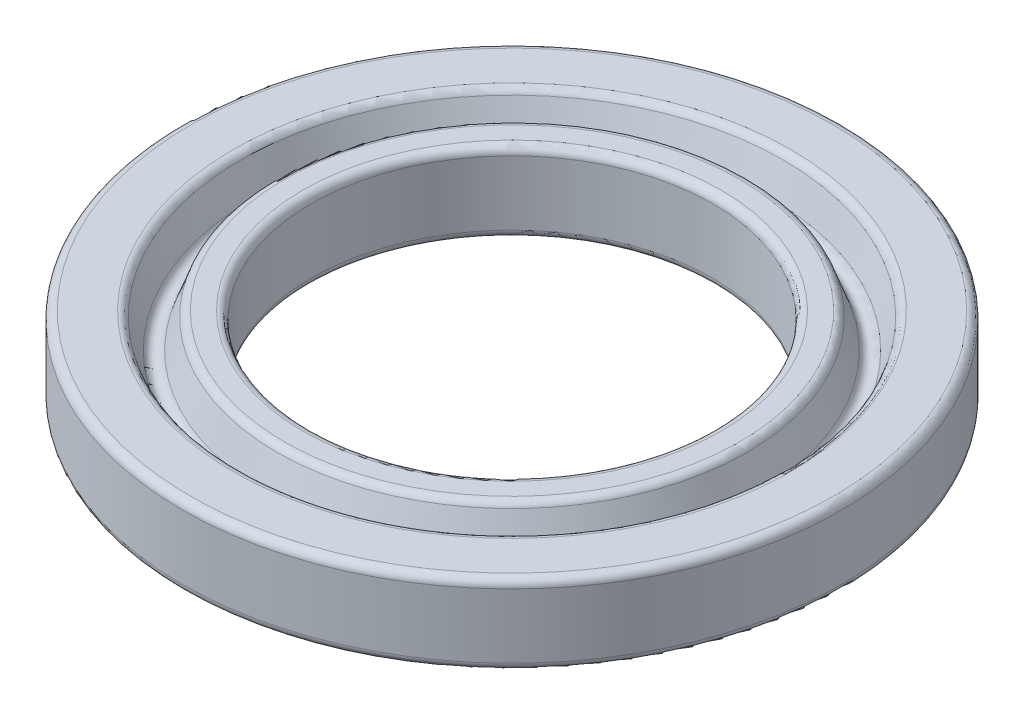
ISO-10303-21;
HEADER;
FILE_DESCRIPTION(('STEP AP214'),'2;1');
FILE_NAME('part.step','',(''),(''),'','','');
FILE_SCHEMA(('AUTOMOTIVE_DESIGN { 1 0 10303 214 1 1 1 1 }'));
ENDSEC;
DATA;
#1=APPLICATION_CONTEXT('core data for automotive mechanical design processes');
#2=APPLICATION_PROTOCOL_DEFINITION('international standard','automotive_design',2000,#1);
#3=PRODUCT_CONTEXT('',#1,'mechanical');
#4=PRODUCT('Part','Part','',(#3));
#5=PRODUCT_RELATED_PRODUCT_CATEGORY('part','',(#4));
#6=PRODUCT_DEFINITION_FORMATION('','',#4);
#7=PRODUCT_DEFINITION_CONTEXT('part definition',#1,'design');
#8=PRODUCT_DEFINITION('design','',#6,#7);
#9=PRODUCT_DEFINITION_SHAPE('','',#8);
#10=(LENGTH_UNIT() NAMED_UNIT(*) SI_UNIT(.MILLI.,.METRE.));
#11=(NAMED_UNIT(*) PLANE_ANGLE_UNIT() SI_UNIT($,.RADIAN.));
#12=(NAMED_UNIT(*) SI_UNIT($,.STERADIAN.) SOLID_ANGLE_UNIT());
#13=UNCERTAINTY_MEASURE_WITH_UNIT(LENGTH_MEASURE(1.E-05),#10,'distance_accuracy_value','');
#14=(GEOMETRIC_REPRESENTATION_CONTEXT(3) GLOBAL_UNCERTAINTY_ASSIGNED_CONTEXT((#13)) GLOBAL_UNIT_ASSIGNED_CONTEXT((#10,
#11,#12)) REPRESENTATION_CONTEXT('',''));
#15=CARTESIAN_POINT('',(0.,0.,0.));
#16=DIRECTION('',(0.,0.,1.));
#17=DIRECTION('',(1.,0.,0.));
#18=AXIS2_PLACEMENT_3D('',#15,#16,#17);
#19=CARTESIAN_POINT('',(0.,40.,0.));
#20=DIRECTION('',(0.,1.,0.));
#21=DIRECTION('',(0.,0.,1.));
#22=AXIS2_PLACEMENT_3D('',#19,#20,#21);
#23=CYLINDRICAL_SURFACE('',#22,6.25000000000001);
#24=CARTESIAN_POINT('',(0.,0.25,0.));
#25=DIRECTION('',(0.,1.,0.));
#26=DIRECTION('',(0.,0.,1.));
#27=AXIS2_PLACEMENT_3D('',#24,#25,#26);
#28=CIRCLE('',#27,6.25000000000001);
#29=CARTESIAN_POINT('',(0.,0.249999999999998,6.25000000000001));
#30=VERTEX_POINT('',#29);
#31=EDGE_CURVE('E62',#30,#30,#28,.F.);
#32=ORIENTED_EDGE('',*,*,#31,.T.);
#33=EDGE_LOOP('',(#32));
#34=FACE_BOUND('',#33,.T.);
#35=CARTESIAN_POINT('',(0.,2.25,0.));
#36=DIRECTION('',(0.,-1.,0.));
#37=DIRECTION('',(0.,0.,-1.));
#38=AXIS2_PLACEMENT_3D('',#35,#36,#37);
#39=CIRCLE('',#38,6.25000000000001);
#40=CARTESIAN_POINT('',(0.,2.25,-6.25000000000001));
#41=VERTEX_POINT('',#40);
#42=EDGE_CURVE('E65',#41,#41,#39,.F.);
#43=ORIENTED_EDGE('',*,*,#42,.T.);
#44=EDGE_LOOP('',(#43));
#45=FACE_BOUND('',#44,.T.);
#46=ADVANCED_FACE('F31',(#34,#45),#23,.F.);
#47=CARTESIAN_POINT('',(6.24999999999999,2.5,0.));
#48=DIRECTION('',(0.,-1.,0.));
#49=DIRECTION('',(0.,0.,-1.));
#50=AXIS2_PLACEMENT_3D('',#47,#48,#49);
#51=PLANE('',#50);
#52=CARTESIAN_POINT('',(0.,2.5,0.));
#53=DIRECTION('',(0.,-1.,0.));
#54=DIRECTION('',(0.,0.,-1.));
#55=AXIS2_PLACEMENT_3D('',#52,#53,#54);
#56=CIRCLE('',#55,7.07494811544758);
#57=CARTESIAN_POINT('',(0.,2.5,-7.07494811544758));
#58=VERTEX_POINT('',#57);
#59=EDGE_CURVE('E41',#58,#58,#56,.F.);
#60=ORIENTED_EDGE('',*,*,#59,.T.);
#61=EDGE_LOOP('',(#60));
#62=FACE_BOUND('',#61,.T.);
#63=CARTESIAN_POINT('',(0.,2.5,0.));
#64=DIRECTION('',(0.,-1.,0.));
#65=DIRECTION('',(0.,0.,-1.));
#66=AXIS2_PLACEMENT_3D('',#63,#64,#65);
#67=CIRCLE('',#66,6.50000000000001);
#68=CARTESIAN_POINT('',(0.,2.5,-6.50000000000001));
#69=VERTEX_POINT('',#68);
#70=EDGE_CURVE('E45',#69,#69,#67,.T.);
#71=ORIENTED_EDGE('',*,*,#70,.T.);
#72=EDGE_LOOP('',(#71));
#73=FACE_BOUND('',#72,.T.);
#74=ADVANCED_FACE('F113',(#62,#73),#51,.F.);
#75=CARTESIAN_POINT('',(0.,0.782826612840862,0.));
#76=DIRECTION('',(0.,-1.,0.));
#77=DIRECTION('',(0.,0.,-1.));
#78=AXIS2_PLACEMENT_3D('',#75,#76,#77);
#79=CONICAL_SURFACE('',#78,7.875,0.349065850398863);
#80=CARTESIAN_POINT('',(0.,1.42827267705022,0.));
#81=DIRECTION('',(0.,-1.,0.));
#82=DIRECTION('',(0.,0.,-1.));
#83=AXIS2_PLACEMENT_3D('',#80,#81,#82);
#84=CIRCLE('',#83,7.64007684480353);
#85=CARTESIAN_POINT('',(0.,1.42827267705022,-7.64007684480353));
#86=VERTEX_POINT('',#85);
#87=EDGE_CURVE('E80',#86,#86,#84,.F.);
#88=ORIENTED_EDGE('',*,*,#87,.T.);
#89=EDGE_LOOP('',(#88));
#90=FACE_BOUND('',#89,.T.);
#91=CARTESIAN_POINT('',(0.,2.33550503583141,0.));
#92=DIRECTION('',(0.,1.,0.));
#93=DIRECTION('',(0.,0.,1.));
#94=AXIS2_PLACEMENT_3D('',#91,#92,#93);
#95=CIRCLE('',#94,7.30987127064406);
#96=CARTESIAN_POINT('',(0.,2.33550503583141,7.30987127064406));
#97=VERTEX_POINT('',#96);
#98=EDGE_CURVE('E83',#97,#97,#95,.F.);
#99=ORIENTED_EDGE('',*,*,#98,.T.);
#100=EDGE_LOOP('',(#99));
#101=FACE_BOUND('',#100,.T.);
#102=ADVANCED_FACE('F118',(#90,#101),#79,.T.);
#103=CARTESIAN_POINT('',(0.,2.5,0.));
#104=DIRECTION('',(0.,1.,0.));
#105=DIRECTION('',(0.,0.,1.));
#106=AXIS2_PLACEMENT_3D('',#103,#104,#105);
#107=CONICAL_SURFACE('',#106,8.50000000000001,0.349065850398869);
#108=CARTESIAN_POINT('',(0.,1.42827267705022,0.));
#109=DIRECTION('',(0.,1.,0.));
#110=DIRECTION('',(0.,0.,1.));
#111=AXIS2_PLACEMENT_3D('',#108,#109,#110);
#112=CIRCLE('',#111,8.10992315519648);
#113=CARTESIAN_POINT('',(0.,1.42827267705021,8.10992315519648));
#114=VERTEX_POINT('',#113);
#115=EDGE_CURVE('E74',#114,#114,#112,.F.);
#116=ORIENTED_EDGE('',*,*,#115,.T.);
#117=EDGE_LOOP('',(#116));
#118=FACE_BOUND('',#117,.T.);
#119=CARTESIAN_POINT('',(0.,2.33550503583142,0.));
#120=DIRECTION('',(0.,-1.,0.));
#121=DIRECTION('',(0.,0.,-1.));
#122=AXIS2_PLACEMENT_3D('',#119,#120,#121);
#123=CIRCLE('',#122,8.44012872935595);
#124=CARTESIAN_POINT('',(0.,2.33550503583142,-8.44012872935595));
#125=VERTEX_POINT('',#124);
#126=EDGE_CURVE('E77',#125,#125,#123,.F.);
#127=ORIENTED_EDGE('',*,*,#126,.T.);
#128=EDGE_LOOP('',(#127));
#129=FACE_BOUND('',#128,.T.);
#130=ADVANCED_FACE('F180',(#118,#129),#107,.F.);
#131=CARTESIAN_POINT('',(8.49999999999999,2.49999999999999,0.));
#132=DIRECTION('',(0.,-1.,0.));
#133=DIRECTION('',(0.,0.,-1.));
#134=AXIS2_PLACEMENT_3D('',#131,#132,#133);
#135=PLANE('',#134);
#136=CARTESIAN_POINT('',(0.,2.5,0.));
#137=DIRECTION('',(0.,-1.,0.));
#138=DIRECTION('',(0.,0.,-1.));
#139=AXIS2_PLACEMENT_3D('',#136,#137,#138);
#140=CIRCLE('',#139,10.);
#141=CARTESIAN_POINT('',(0.,2.5,-10.));
#142=VERTEX_POINT('',#141);
#143=EDGE_CURVE('E56',#142,#142,#140,.F.);
#144=ORIENTED_EDGE('',*,*,#143,.T.);
#145=EDGE_LOOP('',(#144));
#146=FACE_BOUND('',#145,.T.);
#147=CARTESIAN_POINT('',(0.,2.5,0.));
#148=DIRECTION('',(0.,-1.,0.));
#149=DIRECTION('',(0.,0.,-1.));
#150=AXIS2_PLACEMENT_3D('',#147,#148,#149);
#151=CIRCLE('',#150,8.67505188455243);
#152=CARTESIAN_POINT('',(0.,2.5,-8.67505188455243));
#153=VERTEX_POINT('',#152);
#154=EDGE_CURVE('E59',#153,#153,#151,.T.);
#155=ORIENTED_EDGE('',*,*,#154,.T.);
#156=EDGE_LOOP('',(#155));
#157=FACE_BOUND('',#156,.T.);
#158=ADVANCED_FACE('F176',(#146,#157),#135,.F.);
#159=CARTESIAN_POINT('',(0.,40.,0.));
#160=DIRECTION('',(0.,1.,0.));
#161=DIRECTION('',(0.,0.,1.));
#162=AXIS2_PLACEMENT_3D('',#159,#160,#161);
#163=CYLINDRICAL_SURFACE('',#162,10.25);
#164=CARTESIAN_POINT('',(0.,2.25,0.));
#165=DIRECTION('',(0.,-1.,0.));
#166=DIRECTION('',(0.,0.,-1.));
#167=AXIS2_PLACEMENT_3D('',#164,#165,#166);
#168=CIRCLE('',#167,10.25);
#169=CARTESIAN_POINT('',(0.,2.25000000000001,-10.25));
#170=VERTEX_POINT('',#169);
#171=EDGE_CURVE('E50',#170,#170,#168,.T.);
#172=ORIENTED_EDGE('',*,*,#171,.T.);
#173=EDGE_LOOP('',(#172));
#174=FACE_BOUND('',#173,.T.);
#175=CARTESIAN_POINT('',(0.,0.25,0.));
#176=DIRECTION('',(0.,1.,0.));
#177=DIRECTION('',(0.,0.,1.));
#178=AXIS2_PLACEMENT_3D('',#175,#176,#177);
#179=CIRCLE('',#178,10.25);
#180=CARTESIAN_POINT('',(0.,0.249999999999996,10.25));
#181=VERTEX_POINT('',#180);
#182=EDGE_CURVE('E53',#181,#181,#179,.T.);
#183=ORIENTED_EDGE('',*,*,#182,.T.);
#184=EDGE_LOOP('',(#183));
#185=FACE_BOUND('',#184,.T.);
#186=ADVANCED_FACE('F173',(#174,#185),#163,.T.);
#187=CARTESIAN_POINT('',(9.25,0.,0.));
#188=DIRECTION('',(0.,1.,0.));
#189=DIRECTION('',(0.,0.,1.));
#190=AXIS2_PLACEMENT_3D('',#187,#188,#189);
#191=PLANE('',#190);
#192=CARTESIAN_POINT('',(0.,0.,0.));
#193=DIRECTION('',(0.,1.,0.));
#194=DIRECTION('',(0.,0.,1.));
#195=AXIS2_PLACEMENT_3D('',#192,#193,#194);
#196=CIRCLE('',#195,10.);
#197=CARTESIAN_POINT('',(0.,0.,10.));
#198=VERTEX_POINT('',#197);
#199=EDGE_CURVE('E10',#198,#198,#196,.F.);
#200=ORIENTED_EDGE('',*,*,#199,.T.);
#201=EDGE_LOOP('',(#200));
#202=FACE_BOUND('',#201,.T.);
#203=CARTESIAN_POINT('',(0.,0.,0.));
#204=DIRECTION('',(0.,1.,0.));
#205=DIRECTION('',(0.,0.,1.));
#206=AXIS2_PLACEMENT_3D('',#203,#204,#205);
#207=CIRCLE('',#206,9.42505188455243);
#208=CARTESIAN_POINT('',(0.,0.,9.42505188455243));
#209=VERTEX_POINT('',#208);
#210=EDGE_CURVE('E37',#209,#209,#207,.T.);
#211=ORIENTED_EDGE('',*,*,#210,.T.);
#212=EDGE_LOOP('',(#211));
#213=FACE_BOUND('',#212,.T.);
#214=ADVANCED_FACE('F169',(#202,#213),#191,.F.);
#215=CARTESIAN_POINT('',(0.,1.35435968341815,0.));
#216=DIRECTION('',(0.,-1.,0.));
#217=DIRECTION('',(0.,0.,-1.));
#218=AXIS2_PLACEMENT_3D('',#215,#216,#217);
#219=CONICAL_SURFACE('',#218,8.7570533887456,0.349065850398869);
#220=CARTESIAN_POINT('',(0.,0.718003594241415,0.));
#221=DIRECTION('',(0.,-1.,0.));
#222=DIRECTION('',(0.,0.,-1.));
#223=AXIS2_PLACEMENT_3D('',#220,#221,#222);
#224=CIRCLE('',#223,8.98866806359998);
#225=CARTESIAN_POINT('',(0.,0.718003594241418,-8.98866806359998));
#226=VERTEX_POINT('',#225);
#227=EDGE_CURVE('E92',#226,#226,#224,.F.);
#228=ORIENTED_EDGE('',*,*,#227,.T.);
#229=EDGE_LOOP('',(#228));
#230=FACE_BOUND('',#229,.T.);
#231=CARTESIAN_POINT('',(0.,0.164494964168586,0.));
#232=DIRECTION('',(0.,1.,0.));
#233=DIRECTION('',(0.,0.,1.));
#234=AXIS2_PLACEMENT_3D('',#231,#232,#233);
#235=CIRCLE('',#234,9.19012872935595);
#236=CARTESIAN_POINT('',(0.,0.164494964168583,9.19012872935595));
#237=VERTEX_POINT('',#236);
#238=EDGE_CURVE('E95',#237,#237,#235,.F.);
#239=ORIENTED_EDGE('',*,*,#238,.T.);
#240=EDGE_LOOP('',(#239));
#241=FACE_BOUND('',#240,.T.);
#242=ADVANCED_FACE('F99',(#230,#241),#219,.F.);
#243=CARTESIAN_POINT('',(0.,0.,0.));
#244=DIRECTION('',(0.,1.,0.));
#245=DIRECTION('',(0.,0.,1.));
#246=AXIS2_PLACEMENT_3D('',#243,#244,#245);
#247=CONICAL_SURFACE('',#246,8.25000000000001,0.358232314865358);
#248=CARTESIAN_POINT('',(0.,0.720153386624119,0.));
#249=DIRECTION('',(0.,1.,0.));
#250=DIRECTION('',(0.,0.,1.));
#251=AXIS2_PLACEMENT_3D('',#248,#249,#250);
#252=CIRCLE('',#251,8.51961539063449);
#253=CARTESIAN_POINT('',(0.,0.720153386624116,8.51961539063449));
#254=VERTEX_POINT('',#253);
#255=EDGE_CURVE('E86',#254,#254,#252,.F.);
#256=ORIENTED_EDGE('',*,*,#255,.T.);
#257=EDGE_LOOP('',(#256));
#258=FACE_BOUND('',#257,.T.);
#259=CARTESIAN_POINT('',(0.,0.162345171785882,0.));
#260=DIRECTION('',(0.,-1.,0.));
#261=DIRECTION('',(0.,0.,-1.));
#262=AXIS2_PLACEMENT_3D('',#259,#260,#261);
#263=CIRCLE('',#262,8.31077976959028);
#264=CARTESIAN_POINT('',(0.,0.162345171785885,-8.31077976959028));
#265=VERTEX_POINT('',#264);
#266=EDGE_CURVE('E89',#265,#265,#263,.F.);
#267=ORIENTED_EDGE('',*,*,#266,.T.);
#268=EDGE_LOOP('',(#267));
#269=FACE_BOUND('',#268,.T.);
#270=ADVANCED_FACE('F162',(#258,#269),#247,.T.);
#271=CARTESIAN_POINT('',(6.25,0.,0.));
#272=DIRECTION('',(0.,1.,0.));
#273=DIRECTION('',(0.,0.,1.));
#274=AXIS2_PLACEMENT_3D('',#271,#272,#273);
#275=PLANE('',#274);
#276=CARTESIAN_POINT('',(0.,0.,0.));
#277=DIRECTION('',(0.,1.,0.));
#278=DIRECTION('',(0.,0.,1.));
#279=AXIS2_PLACEMENT_3D('',#276,#277,#278);
#280=CIRCLE('',#279,8.07665025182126);
#281=CARTESIAN_POINT('',(0.,0.,8.07665025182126));
#282=VERTEX_POINT('',#281);
#283=EDGE_CURVE('E68',#282,#282,#280,.F.);
#284=ORIENTED_EDGE('',*,*,#283,.T.);
#285=EDGE_LOOP('',(#284));
#286=FACE_BOUND('',#285,.T.);
#287=CARTESIAN_POINT('',(0.,0.,0.));
#288=DIRECTION('',(0.,1.,0.));
#289=DIRECTION('',(0.,0.,1.));
#290=AXIS2_PLACEMENT_3D('',#287,#288,#289);
#291=CIRCLE('',#290,6.50000000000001);
#292=CARTESIAN_POINT('',(0.,0.,6.50000000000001));
#293=VERTEX_POINT('',#292);
#294=EDGE_CURVE('E71',#293,#293,#291,.T.);
#295=ORIENTED_EDGE('',*,*,#294,.T.);
#296=EDGE_LOOP('',(#295));
#297=FACE_BOUND('',#296,.T.);
#298=ADVANCED_FACE('F158',(#286,#297),#275,.F.);
#299=CARTESIAN_POINT('',(0.,0.632498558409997,0.));
#300=DIRECTION('',(0.,1.,0.));
#301=DIRECTION('',(0.,0.,1.));
#302=AXIS2_PLACEMENT_3D('',#299,#300,#301);
#303=TOROIDAL_SURFACE('',#302,8.7537449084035,0.25);
#304=ORIENTED_EDGE('',*,*,#255,.F.);
#305=EDGE_LOOP('',(#304));
#306=FACE_BOUND('',#305,.T.);
#307=ORIENTED_EDGE('',*,*,#227,.F.);
#308=EDGE_LOOP('',(#307));
#309=FACE_BOUND('',#308,.T.);
#310=ADVANCED_FACE('F154',(#306,#309),#303,.F.);
#311=CARTESIAN_POINT('',(0.,1.51377771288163,0.));
#312=DIRECTION('',(0.,1.,0.));
#313=DIRECTION('',(0.,0.,1.));
#314=AXIS2_PLACEMENT_3D('',#311,#312,#313);
#315=TOROIDAL_SURFACE('',#314,7.875,0.25);
#316=ORIENTED_EDGE('',*,*,#115,.F.);
#317=EDGE_LOOP('',(#316));
#318=FACE_BOUND('',#317,.T.);
#319=ORIENTED_EDGE('',*,*,#87,.F.);
#320=EDGE_LOOP('',(#319));
#321=FACE_BOUND('',#320,.T.);
#322=ADVANCED_FACE('F150',(#318,#321),#315,.F.);
#323=CARTESIAN_POINT('',(0.,0.25,0.));
#324=DIRECTION('',(0.,1.,0.));
#325=DIRECTION('',(0.,0.,1.));
#326=AXIS2_PLACEMENT_3D('',#323,#324,#325);
#327=TOROIDAL_SURFACE('',#326,8.07665025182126,0.25);
#328=ORIENTED_EDGE('',*,*,#283,.F.);
#329=EDGE_LOOP('',(#328));
#330=FACE_BOUND('',#329,.T.);
#331=ORIENTED_EDGE('',*,*,#266,.F.);
#332=EDGE_LOOP('',(#331));
#333=FACE_BOUND('',#332,.T.);
#334=ADVANCED_FACE('F146',(#330,#333),#327,.T.);
#335=CARTESIAN_POINT('',(0.,0.25,0.));
#336=DIRECTION('',(0.,1.,0.));
#337=DIRECTION('',(0.,0.,1.));
#338=AXIS2_PLACEMENT_3D('',#335,#336,#337);
#339=TOROIDAL_SURFACE('',#338,6.50000000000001,0.25);
#340=ORIENTED_EDGE('',*,*,#31,.F.);
#341=EDGE_LOOP('',(#340));
#342=FACE_BOUND('',#341,.T.);
#343=ORIENTED_EDGE('',*,*,#294,.F.);
#344=EDGE_LOOP('',(#343));
#345=FACE_BOUND('',#344,.T.);
#346=ADVANCED_FACE('F142',(#342,#345),#339,.T.);
#347=CARTESIAN_POINT('',(0.,2.25,0.));
#348=DIRECTION('',(0.,-1.,0.));
#349=DIRECTION('',(0.,0.,-1.));
#350=AXIS2_PLACEMENT_3D('',#347,#348,#349);
#351=TOROIDAL_SURFACE('',#350,10.,0.25);
#352=ORIENTED_EDGE('',*,*,#171,.F.);
#353=EDGE_LOOP('',(#352));
#354=FACE_BOUND('',#353,.T.);
#355=ORIENTED_EDGE('',*,*,#143,.F.);
#356=EDGE_LOOP('',(#355));
#357=FACE_BOUND('',#356,.T.);
#358=ADVANCED_FACE('F138',(#354,#357),#351,.T.);
#359=CARTESIAN_POINT('',(0.,2.25,0.));
#360=DIRECTION('',(0.,-1.,0.));
#361=DIRECTION('',(0.,0.,-1.));
#362=AXIS2_PLACEMENT_3D('',#359,#360,#361);
#363=TOROIDAL_SURFACE('',#362,8.67505188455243,0.25);
#364=ORIENTED_EDGE('',*,*,#154,.F.);
#365=EDGE_LOOP('',(#364));
#366=FACE_BOUND('',#365,.T.);
#367=ORIENTED_EDGE('',*,*,#126,.F.);
#368=EDGE_LOOP('',(#367));
#369=FACE_BOUND('',#368,.T.);
#370=ADVANCED_FACE('F131',(#366,#369),#363,.T.);
#371=CARTESIAN_POINT('',(0.,2.25,0.));
#372=DIRECTION('',(0.,-1.,0.));
#373=DIRECTION('',(0.,0.,-1.));
#374=AXIS2_PLACEMENT_3D('',#371,#372,#373);
#375=TOROIDAL_SURFACE('',#374,7.07494811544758,0.25);
#376=ORIENTED_EDGE('',*,*,#98,.F.);
#377=EDGE_LOOP('',(#376));
#378=FACE_BOUND('',#377,.T.);
#379=ORIENTED_EDGE('',*,*,#59,.F.);
#380=EDGE_LOOP('',(#379));
#381=FACE_BOUND('',#380,.T.);
#382=ADVANCED_FACE('F125',(#378,#381),#375,.T.);
#383=CARTESIAN_POINT('',(0.,2.25,0.));
#384=DIRECTION('',(0.,-1.,0.));
#385=DIRECTION('',(0.,0.,-1.));
#386=AXIS2_PLACEMENT_3D('',#383,#384,#385);
#387=TOROIDAL_SURFACE('',#386,6.50000000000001,0.25);
#388=ORIENTED_EDGE('',*,*,#70,.F.);
#389=EDGE_LOOP('',(#388));
#390=FACE_BOUND('',#389,.T.);
#391=ORIENTED_EDGE('',*,*,#42,.F.);
#392=EDGE_LOOP('',(#391));
#393=FACE_BOUND('',#392,.T.);
#394=ADVANCED_FACE('F109',(#390,#393),#387,.T.);
#395=CARTESIAN_POINT('',(0.,0.25,0.));
#396=DIRECTION('',(0.,1.,0.));
#397=DIRECTION('',(0.,0.,1.));
#398=AXIS2_PLACEMENT_3D('',#395,#396,#397);
#399=TOROIDAL_SURFACE('',#398,10.,0.25);
#400=ORIENTED_EDGE('',*,*,#199,.F.);
#401=EDGE_LOOP('',(#400));
#402=FACE_BOUND('',#401,.T.);
#403=ORIENTED_EDGE('',*,*,#182,.F.);
#404=EDGE_LOOP('',(#403));
#405=FACE_BOUND('',#404,.T.);
#406=ADVANCED_FACE('F104',(#402,#405),#399,.T.);
#407=CARTESIAN_POINT('',(0.,0.25,0.));
#408=DIRECTION('',(0.,1.,0.));
#409=DIRECTION('',(0.,0.,1.));
#410=AXIS2_PLACEMENT_3D('',#407,#408,#409);
#411=TOROIDAL_SURFACE('',#410,9.42505188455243,0.25);
#412=ORIENTED_EDGE('',*,*,#238,.F.);
#413=EDGE_LOOP('',(#412));
#414=FACE_BOUND('',#413,.T.);
#415=ORIENTED_EDGE('',*,*,#210,.F.);
#416=EDGE_LOOP('',(#415));
#417=FACE_BOUND('',#416,.T.);
#418=ADVANCED_FACE('F101',(#414,#417),#411,.T.);
#419=CLOSED_SHELL('',(#46,#74,#102,#130,#158,#186,#214,#242,#270,#298,#310,#322,#334,#346,#358,
#370,#382,#394,#406,#418));
#420=MANIFOLD_SOLID_BREP('B2',#419);
#421=ADVANCED_BREP_SHAPE_REPRESENTATION('',(#18,#420),#14);
#422=SHAPE_DEFINITION_REPRESENTATION(#9,#421);
ENDSEC;
END-ISO-10303-21;
